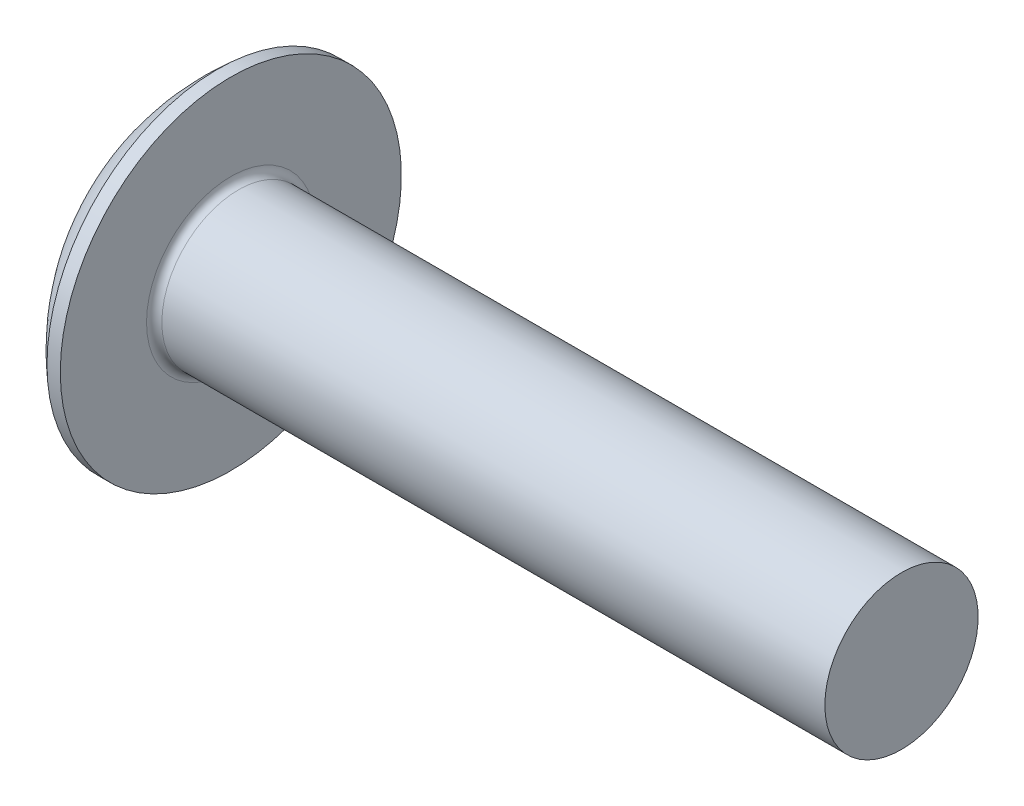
from build123d import *

# Parameters (mm, degrees)
FILLET1_R  = 0.4
SKETCH2_W  = 17.8
SKETCH2_H  = 1.6
SLOT_DEPTH = 2.4


with BuildPart() as part:
    # BodySke → Base-Revolve (revolve)
    with BuildSketch(Plane.XY, mode=Mode.PRIVATE) as base_revolve_sk:
        with BuildLine():
            Line((4.8, 4), (4.8, 8.9))
            Line((4.8, 8.9), (4.105264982, 8.9))
            ThreePointArc((4.105264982, 8.9), (1.075772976, 4.900591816), (0, 0))
            Line((0, 0), (39.8, 0))
            Line((39.8, 0), (39.8, 4))
            Line((39.8, 4), (4.8, 4))
        make_face()
    revolve(base_revolve_sk.sketch.rotate(Axis((-25.4, 0, 0), (1, 0, 0)), 90), axis=Axis((-25.4, 0, 0), (1, 0, 0)))

    # Fillet1
    fillet1_edges = [part.edges().sort_by_distance(p)[0] for p in [
        (4.8, 0, -4),
    ]]
    fillet(fillet1_edges, radius=FILLET1_R)

    # Sketch2 → Slot (cut)
    with BuildSketch(Plane(origin=(0, 0, 0), x_dir=(0, 0, -1), z_dir=(1, 0, 0))):
        Rectangle(SKETCH2_W, SKETCH2_H)
    extrude(amount=SLOT_DEPTH, mode=Mode.SUBTRACT)


solid = part.part
